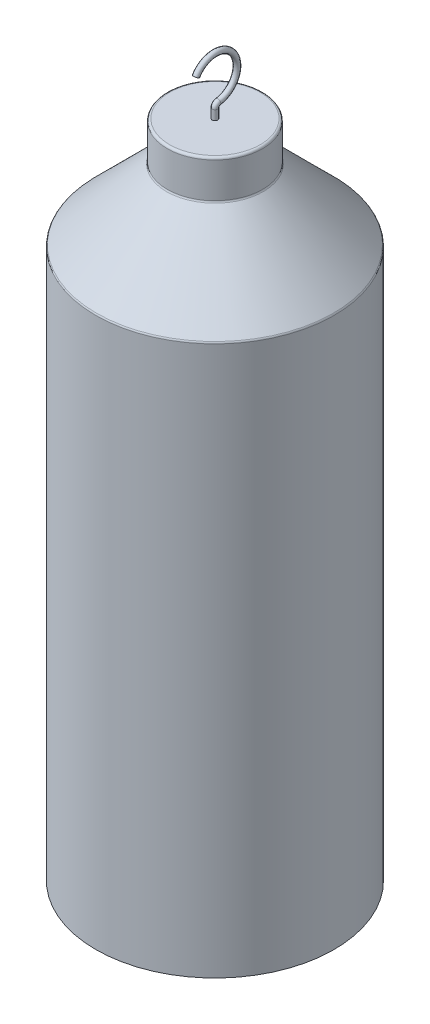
ISO-10303-21;
HEADER;
FILE_DESCRIPTION(('STEP AP214'),'2;1');
FILE_NAME('part.step','',(''),(''),'','','');
FILE_SCHEMA(('AUTOMOTIVE_DESIGN { 1 0 10303 214 1 1 1 1 }'));
ENDSEC;
DATA;
#1=APPLICATION_CONTEXT('core data for automotive mechanical design processes');
#2=APPLICATION_PROTOCOL_DEFINITION('international standard','automotive_design',2000,#1);
#3=PRODUCT_CONTEXT('',#1,'mechanical');
#4=PRODUCT('Part','Part','',(#3));
#5=PRODUCT_RELATED_PRODUCT_CATEGORY('part','',(#4));
#6=PRODUCT_DEFINITION_FORMATION('','',#4);
#7=PRODUCT_DEFINITION_CONTEXT('part definition',#1,'design');
#8=PRODUCT_DEFINITION('design','',#6,#7);
#9=PRODUCT_DEFINITION_SHAPE('','',#8);
#10=(LENGTH_UNIT() NAMED_UNIT(*) SI_UNIT(.MILLI.,.METRE.));
#11=(NAMED_UNIT(*) PLANE_ANGLE_UNIT() SI_UNIT($,.RADIAN.));
#12=(NAMED_UNIT(*) SI_UNIT($,.STERADIAN.) SOLID_ANGLE_UNIT());
#13=UNCERTAINTY_MEASURE_WITH_UNIT(LENGTH_MEASURE(1.E-05),#10,'distance_accuracy_value','');
#14=(GEOMETRIC_REPRESENTATION_CONTEXT(3) GLOBAL_UNCERTAINTY_ASSIGNED_CONTEXT((#13)) GLOBAL_UNIT_ASSIGNED_CONTEXT((#10,
#11,#12)) REPRESENTATION_CONTEXT('',''));
#15=CARTESIAN_POINT('',(0.,0.,0.));
#16=DIRECTION('',(0.,0.,1.));
#17=DIRECTION('',(1.,0.,0.));
#18=AXIS2_PLACEMENT_3D('',#15,#16,#17);
#19=CARTESIAN_POINT('',(0.,189.5,0.));
#20=DIRECTION('',(1.,0.,0.));
#21=DIRECTION('',(0.,0.,-1.));
#22=AXIS2_PLACEMENT_3D('',#19,#20,#21);
#23=TOROIDAL_SURFACE('',#22,6.00000000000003,0.75);
#24=CARTESIAN_POINT('',(0.,183.561540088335,-0.857142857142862));
#25=DIRECTION('',(0.,0.142857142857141,-0.989743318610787));
#26=DIRECTION('',(0.,0.989743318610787,0.142857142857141));
#27=AXIS2_PLACEMENT_3D('',#24,#25,#26);
#28=CIRCLE('',#27,0.75);
#29=CARTESIAN_POINT('',(0.,182.819232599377,-0.964285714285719));
#30=VERTEX_POINT('',#29);
#31=EDGE_CURVE('E42',#30,#30,#28,.T.);
#32=CARTESIAN_POINT('',(0.,192.5,5.19615242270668));
#33=DIRECTION('',(0.,-0.866025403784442,0.499999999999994));
#34=DIRECTION('',(0.,-0.499999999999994,-0.866025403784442));
#35=AXIS2_PLACEMENT_3D('',#32,#33,#34);
#36=CIRCLE('',#35,0.75);
#37=CARTESIAN_POINT('',(0.,192.875,5.84567147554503));
#38=VERTEX_POINT('',#37);
#39=EDGE_CURVE('E11',#38,#38,#36,.T.);
#40=CARTESIAN_POINT('',(0.,189.5,0.));
#41=DIRECTION('',(1.,0.,0.));
#42=DIRECTION('',(0.,0.,-1.));
#43=AXIS2_PLACEMENT_3D('',#40,#41,#42);
#44=CIRCLE('',#43,6.75000000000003);
#45=EDGE_CURVE('',#30,#38,#44,.T.);
#46=ORIENTED_EDGE('',*,*,#31,.T.);
#47=ORIENTED_EDGE('',*,*,#39,.F.);
#48=ORIENTED_EDGE('',*,*,#45,.T.);
#49=ORIENTED_EDGE('',*,*,#45,.F.);
#50=EDGE_LOOP('',(#46,#48,#47,#49));
#51=FACE_BOUND('',#50,.T.);
#52=ADVANCED_FACE('F36',(#51),#23,.T.);
#53=CARTESIAN_POINT('',(0.,182.571796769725,-1.));
#54=DIRECTION('',(-1.,0.,0.));
#55=DIRECTION('',(0.,0.,1.));
#56=AXIS2_PLACEMENT_3D('',#53,#54,#55);
#57=TOROIDAL_SURFACE('',#56,1.,0.75);
#58=CARTESIAN_POINT('',(0.,182.571796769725,0.));
#59=DIRECTION('',(0.,1.,0.));
#60=DIRECTION('',(0.,0.,1.));
#61=AXIS2_PLACEMENT_3D('',#58,#59,#60);
#62=CIRCLE('',#61,0.75);
#63=CARTESIAN_POINT('',(0.,182.571796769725,0.75));
#64=VERTEX_POINT('',#63);
#65=EDGE_CURVE('E46',#64,#64,#62,.T.);
#66=ORIENTED_EDGE('',*,*,#65,.T.);
#67=EDGE_LOOP('',(#66));
#68=FACE_BOUND('',#67,.T.);
#69=ORIENTED_EDGE('',*,*,#31,.F.);
#70=EDGE_LOOP('',(#69));
#71=FACE_BOUND('',#70,.T.);
#72=ADVANCED_FACE('F68',(#68,#71),#57,.T.);
#73=CARTESIAN_POINT('',(0.,182.571796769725,0.));
#74=DIRECTION('',(0.,-1.,0.));
#75=DIRECTION('',(0.,0.,-1.));
#76=AXIS2_PLACEMENT_3D('',#73,#74,#75);
#77=CYLINDRICAL_SURFACE('',#76,0.75);
#78=ORIENTED_EDGE('',*,*,#65,.F.);
#79=EDGE_LOOP('',(#78));
#80=FACE_BOUND('',#79,.T.);
#81=CARTESIAN_POINT('',(0.,169.5,0.));
#82=DIRECTION('',(0.,1.,0.));
#83=DIRECTION('',(0.,0.,1.));
#84=AXIS2_PLACEMENT_3D('',#81,#82,#83);
#85=CIRCLE('',#84,0.75);
#86=CARTESIAN_POINT('',(0.,169.5,0.75));
#87=VERTEX_POINT('',#86);
#88=EDGE_CURVE('E50',#87,#87,#85,.T.);
#89=ORIENTED_EDGE('',*,*,#88,.T.);
#90=EDGE_LOOP('',(#89));
#91=FACE_BOUND('',#90,.T.);
#92=ADVANCED_FACE('F56',(#80,#91),#77,.T.);
#93=CARTESIAN_POINT('',(0.,192.5,5.19615242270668));
#94=DIRECTION('',(0.,-0.866025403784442,0.499999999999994));
#95=DIRECTION('',(0.,-0.499999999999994,-0.866025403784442));
#96=AXIS2_PLACEMENT_3D('',#93,#94,#95);
#97=PLANE('',#96);
#98=ORIENTED_EDGE('',*,*,#39,.T.);
#99=EDGE_LOOP('',(#98));
#100=FACE_BOUND('',#99,.T.);
#101=ADVANCED_FACE('F60',(#100),#97,.T.);
#102=CARTESIAN_POINT('',(0.,169.5,0.));
#103=DIRECTION('',(0.,1.,0.));
#104=DIRECTION('',(0.,0.,1.));
#105=AXIS2_PLACEMENT_3D('',#102,#103,#104);
#106=PLANE('',#105);
#107=ORIENTED_EDGE('',*,*,#88,.F.);
#108=EDGE_LOOP('',(#107));
#109=FACE_BOUND('',#108,.T.);
#110=ADVANCED_FACE('F58',(#109),#106,.F.);
#111=CLOSED_SHELL('',(#52,#72,#92,#101,#110));
#112=MANIFOLD_SOLID_BREP('B2',#111);
#113=CARTESIAN_POINT('',(0.,0.,0.));
#114=DIRECTION('',(0.,1.,0.));
#115=DIRECTION('',(0.,0.,1.));
#116=AXIS2_PLACEMENT_3D('',#113,#114,#115);
#117=PLANE('',#116);
#118=CARTESIAN_POINT('',(0.,0.,0.));
#119=DIRECTION('',(0.,1.,0.));
#120=DIRECTION('',(0.,0.,1.));
#121=AXIS2_PLACEMENT_3D('',#118,#119,#120);
#122=CIRCLE('',#121,32.5);
#123=CARTESIAN_POINT('',(0.,0.,32.5));
#124=VERTEX_POINT('',#123);
#125=EDGE_CURVE('E35',#124,#124,#122,.T.);
#126=ORIENTED_EDGE('',*,*,#125,.F.);
#127=EDGE_LOOP('',(#126));
#128=FACE_BOUND('',#127,.T.);
#129=ADVANCED_FACE('F106',(#128),#117,.F.);
#130=CARTESIAN_POINT('',(0.,169.5,0.));
#131=DIRECTION('',(0.,1.,0.));
#132=DIRECTION('',(0.,0.,1.));
#133=AXIS2_PLACEMENT_3D('',#130,#131,#132);
#134=CYLINDRICAL_SURFACE('',#133,32.5);
#135=CARTESIAN_POINT('',(0.,149.736974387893,0.));
#136=DIRECTION('',(0.,1.,0.));
#137=DIRECTION('',(0.,0.,1.));
#138=AXIS2_PLACEMENT_3D('',#135,#136,#137);
#139=CIRCLE('',#138,32.5);
#140=CARTESIAN_POINT('',(0.,149.736974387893,32.5));
#141=VERTEX_POINT('',#140);
#142=EDGE_CURVE('E112',#141,#141,#139,.T.);
#143=ORIENTED_EDGE('',*,*,#142,.F.);
#144=EDGE_LOOP('',(#143));
#145=FACE_BOUND('',#144,.T.);
#146=ORIENTED_EDGE('',*,*,#125,.T.);
#147=EDGE_LOOP('',(#146));
#148=FACE_BOUND('',#147,.T.);
#149=ADVANCED_FACE('F181',(#145,#148),#134,.T.);
#150=CARTESIAN_POINT('',(0.,149.736974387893,0.));
#151=DIRECTION('',(0.,1.,0.));
#152=DIRECTION('',(0.,0.,1.));
#153=AXIS2_PLACEMENT_3D('',#150,#151,#152);
#154=TOROIDAL_SURFACE('',#153,31.865,0.634999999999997);
#155=CARTESIAN_POINT('',(0.,150.185987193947,0.));
#156=DIRECTION('',(0.,1.,0.));
#157=DIRECTION('',(0.,0.,1.));
#158=AXIS2_PLACEMENT_3D('',#155,#156,#157);
#159=CIRCLE('',#158,32.3140128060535);
#160=CARTESIAN_POINT('',(0.,150.185987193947,32.3140128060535));
#161=VERTEX_POINT('',#160);
#162=EDGE_CURVE('E116',#161,#161,#159,.T.);
#163=ORIENTED_EDGE('',*,*,#162,.F.);
#164=EDGE_LOOP('',(#163));
#165=FACE_BOUND('',#164,.T.);
#166=ORIENTED_EDGE('',*,*,#142,.T.);
#167=EDGE_LOOP('',(#166));
#168=FACE_BOUND('',#167,.T.);
#169=ADVANCED_FACE('F176',(#165,#168),#154,.T.);
#170=CARTESIAN_POINT('',(0.,150.185987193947,0.));
#171=DIRECTION('',(0.,-1.,0.));
#172=DIRECTION('',(0.,0.,-1.));
#173=AXIS2_PLACEMENT_3D('',#170,#171,#172);
#174=CONICAL_SURFACE('',#173,32.3140128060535,0.785398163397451);
#175=CARTESIAN_POINT('',(0.,169.314012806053,0.));
#176=DIRECTION('',(0.,1.,0.));
#177=DIRECTION('',(0.,0.,1.));
#178=AXIS2_PLACEMENT_3D('',#175,#176,#177);
#179=CIRCLE('',#178,13.1859871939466);
#180=CARTESIAN_POINT('',(0.,169.314012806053,13.1859871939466));
#181=VERTEX_POINT('',#180);
#182=EDGE_CURVE('E120',#181,#181,#179,.T.);
#183=ORIENTED_EDGE('',*,*,#182,.F.);
#184=EDGE_LOOP('',(#183));
#185=FACE_BOUND('',#184,.T.);
#186=ORIENTED_EDGE('',*,*,#162,.T.);
#187=EDGE_LOOP('',(#186));
#188=FACE_BOUND('',#187,.T.);
#189=ADVANCED_FACE('F170',(#185,#188),#174,.T.);
#190=CARTESIAN_POINT('',(0.,169.763025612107,0.));
#191=DIRECTION('',(0.,1.,0.));
#192=DIRECTION('',(0.,0.,1.));
#193=AXIS2_PLACEMENT_3D('',#190,#191,#192);
#194=TOROIDAL_SURFACE('',#193,13.635,0.635000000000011);
#195=CARTESIAN_POINT('',(0.,169.763025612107,0.));
#196=DIRECTION('',(0.,1.,0.));
#197=DIRECTION('',(0.,0.,1.));
#198=AXIS2_PLACEMENT_3D('',#195,#196,#197);
#199=CIRCLE('',#198,13.);
#200=CARTESIAN_POINT('',(0.,169.763025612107,13.));
#201=VERTEX_POINT('',#200);
#202=EDGE_CURVE('E125',#201,#201,#199,.T.);
#203=ORIENTED_EDGE('',*,*,#202,.F.);
#204=EDGE_LOOP('',(#203));
#205=FACE_BOUND('',#204,.T.);
#206=ORIENTED_EDGE('',*,*,#182,.T.);
#207=EDGE_LOOP('',(#206));
#208=FACE_BOUND('',#207,.T.);
#209=ADVANCED_FACE('F164',(#205,#208),#194,.F.);
#210=CARTESIAN_POINT('',(0.,169.5,0.));
#211=DIRECTION('',(0.,1.,0.));
#212=DIRECTION('',(0.,0.,1.));
#213=AXIS2_PLACEMENT_3D('',#210,#211,#212);
#214=CYLINDRICAL_SURFACE('',#213,13.);
#215=CARTESIAN_POINT('',(0.,179.365,0.));
#216=DIRECTION('',(0.,1.,0.));
#217=DIRECTION('',(0.,0.,1.));
#218=AXIS2_PLACEMENT_3D('',#215,#216,#217);
#219=CIRCLE('',#218,13.);
#220=CARTESIAN_POINT('',(0.,179.365,13.));
#221=VERTEX_POINT('',#220);
#222=EDGE_CURVE('E128',#221,#221,#219,.T.);
#223=ORIENTED_EDGE('',*,*,#222,.F.);
#224=EDGE_LOOP('',(#223));
#225=FACE_BOUND('',#224,.T.);
#226=ORIENTED_EDGE('',*,*,#202,.T.);
#227=EDGE_LOOP('',(#226));
#228=FACE_BOUND('',#227,.T.);
#229=ADVANCED_FACE('F158',(#225,#228),#214,.T.);
#230=CARTESIAN_POINT('',(0.,179.365,0.));
#231=DIRECTION('',(0.,1.,0.));
#232=DIRECTION('',(0.,0.,1.));
#233=AXIS2_PLACEMENT_3D('',#230,#231,#232);
#234=TOROIDAL_SURFACE('',#233,12.365,0.634999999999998);
#235=CARTESIAN_POINT('',(0.,180.,0.));
#236=DIRECTION('',(0.,1.,0.));
#237=DIRECTION('',(0.,0.,1.));
#238=AXIS2_PLACEMENT_3D('',#235,#236,#237);
#239=CIRCLE('',#238,12.365);
#240=CARTESIAN_POINT('',(0.,180.,12.365));
#241=VERTEX_POINT('',#240);
#242=EDGE_CURVE('E131',#241,#241,#239,.T.);
#243=ORIENTED_EDGE('',*,*,#242,.F.);
#244=EDGE_LOOP('',(#243));
#245=FACE_BOUND('',#244,.T.);
#246=ORIENTED_EDGE('',*,*,#222,.T.);
#247=EDGE_LOOP('',(#246));
#248=FACE_BOUND('',#247,.T.);
#249=ADVANCED_FACE('F152',(#245,#248),#234,.T.);
#250=CARTESIAN_POINT('',(0.,180.,-12.365));
#251=DIRECTION('',(0.,-1.,0.));
#252=DIRECTION('',(0.,0.,-1.));
#253=AXIS2_PLACEMENT_3D('',#250,#251,#252);
#254=PLANE('',#253);
#255=CARTESIAN_POINT('',(0.,180.,0.));
#256=DIRECTION('',(0.,1.,0.));
#257=DIRECTION('',(0.,0.,1.));
#258=AXIS2_PLACEMENT_3D('',#255,#256,#257);
#259=CIRCLE('',#258,0.749999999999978);
#260=CARTESIAN_POINT('',(0.,180.,0.749999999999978));
#261=VERTEX_POINT('',#260);
#262=EDGE_CURVE('E134',#261,#261,#259,.T.);
#263=ORIENTED_EDGE('',*,*,#262,.F.);
#264=EDGE_LOOP('',(#263));
#265=FACE_BOUND('',#264,.T.);
#266=ORIENTED_EDGE('',*,*,#242,.T.);
#267=EDGE_LOOP('',(#266));
#268=FACE_BOUND('',#267,.T.);
#269=ADVANCED_FACE('F146',(#265,#268),#254,.F.);
#270=CARTESIAN_POINT('',(0.,169.5,0.));
#271=DIRECTION('',(0.,1.,0.));
#272=DIRECTION('',(0.,0.,1.));
#273=AXIS2_PLACEMENT_3D('',#270,#271,#272);
#274=CYLINDRICAL_SURFACE('',#273,0.749999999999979);
#275=CARTESIAN_POINT('',(0.,169.5,0.));
#276=DIRECTION('',(0.,1.,0.));
#277=DIRECTION('',(0.,0.,1.));
#278=AXIS2_PLACEMENT_3D('',#275,#276,#277);
#279=CIRCLE('',#278,0.749999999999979);
#280=CARTESIAN_POINT('',(0.,169.5,0.749999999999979));
#281=VERTEX_POINT('',#280);
#282=EDGE_CURVE('E137',#281,#281,#279,.T.);
#283=ORIENTED_EDGE('',*,*,#282,.F.);
#284=EDGE_LOOP('',(#283));
#285=FACE_BOUND('',#284,.T.);
#286=ORIENTED_EDGE('',*,*,#262,.T.);
#287=EDGE_LOOP('',(#286));
#288=FACE_BOUND('',#287,.T.);
#289=ADVANCED_FACE('F143',(#285,#288),#274,.F.);
#290=CARTESIAN_POINT('',(0.,169.5,-0.749999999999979));
#291=DIRECTION('',(0.,-1.,0.));
#292=DIRECTION('',(0.,0.,-1.));
#293=AXIS2_PLACEMENT_3D('',#290,#291,#292);
#294=PLANE('',#293);
#295=ORIENTED_EDGE('',*,*,#282,.T.);
#296=EDGE_LOOP('',(#295));
#297=FACE_BOUND('',#296,.T.);
#298=ADVANCED_FACE('F141',(#297),#294,.F.);
#299=CLOSED_SHELL('',(#129,#149,#169,#189,#209,#229,#249,#269,#289,#298));
#300=MANIFOLD_SOLID_BREP('B6',#299);
#301=ADVANCED_BREP_SHAPE_REPRESENTATION('',(#18,#112,#300),#14);
#302=SHAPE_DEFINITION_REPRESENTATION(#9,#301);
ENDSEC;
END-ISO-10303-21;
